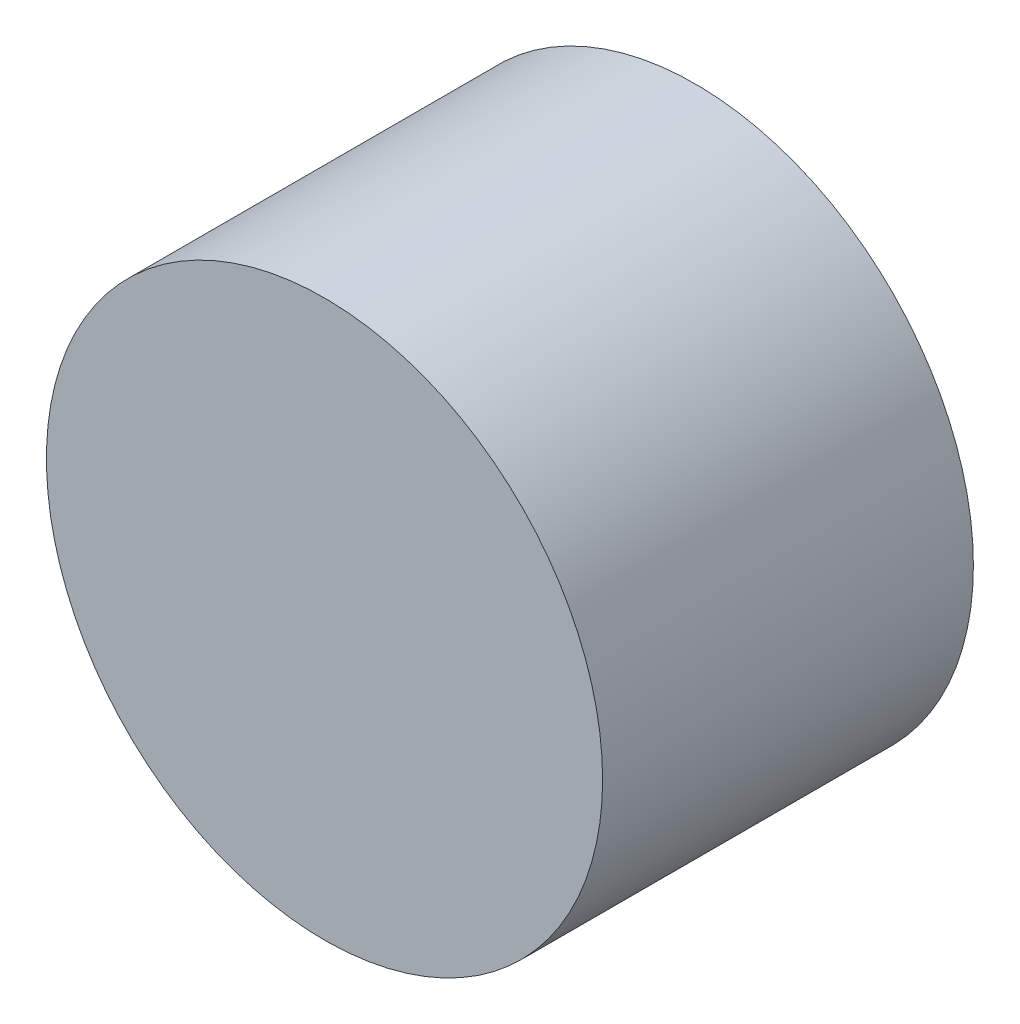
from build123d import *

# Parameters (mm, degrees)
ESQUISSE1_R      = 3
EXTRUSION1_DEPTH = 4


with BuildPart() as part:
    # Esquisse1 → Extrusion1 (new body)
    with BuildSketch(Plane.XY):
        Circle(ESQUISSE1_R)
    extrude(amount=EXTRUSION1_DEPTH)


solid = part.part
